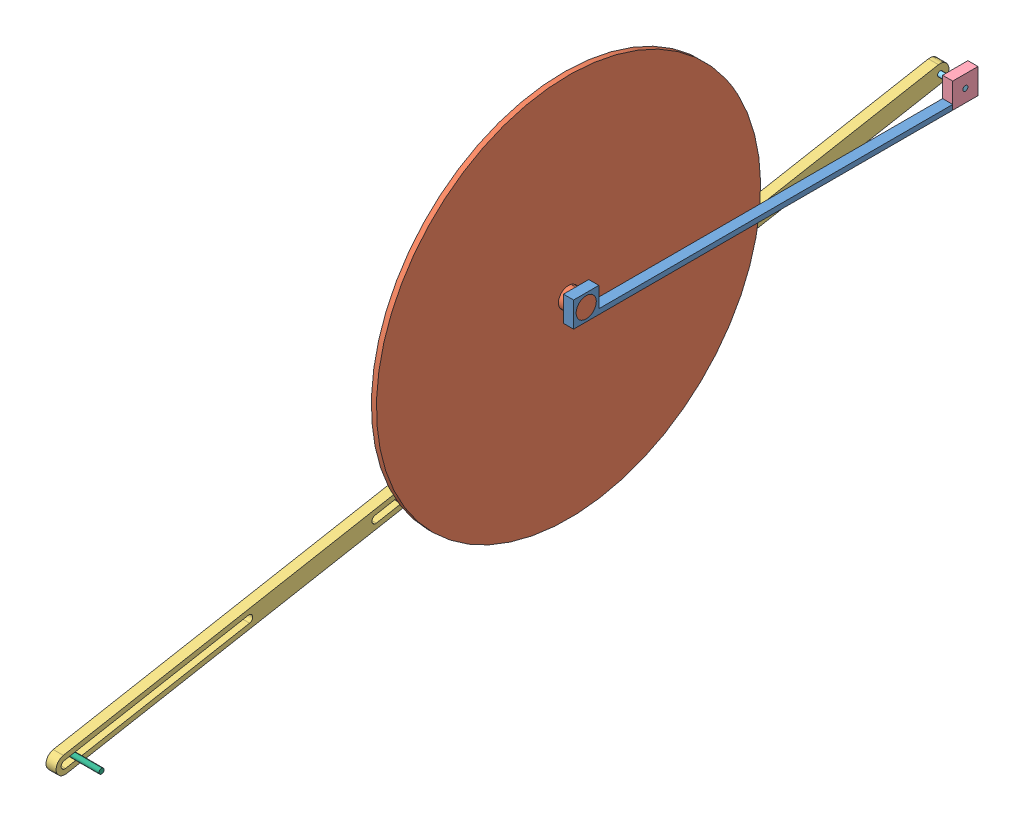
SolidWorks assembly fws.SLDASM, configuration Default (file format 7000). Lengths in mm.
Overall size (71.55 1045.35 1776.47).
6 component instances, 6 part files, 9 mates.
Components (placement in the parent):
- fw holder-1: fw holder.SLDPRT [Default] at (-10.3585 -21.7406 22.9748) size (20 50 750)
- flywheel-1: flywheel.SLDPRT [Default] at (-35.3585 3.2594 -2.0252) x (1 0 0) z (0 -0.523335 0.852127) size (70 760 760)
- qr handle-1: qr handle.SLDPRT [Default] at (-60.3585 3.2594 -752.0252) x (1 0 0) z (0 0.180476 -0.983579) size (20 35 1795)
- qr handle holder-1: qr handle holder.SLDPRT [Default] at (-10.3585 -21.7406 -727.0252) size (20 50 50)
- pin qr-1: pin qr.SLDPRT [Default] at (-60.3585 3.2594 -752.0252) size (70 10 10)
- pin666-1: pin666.SLDPRT [Default] at (11.1885 -310.5335 958.1174) x (0 0 -1) z (1 0 0) size (10 10 71.55)
Mates (geometry in assembly coordinates):
- Coincident1: coincident anti-aligned: plane of fw holder-1 through (-10.3585 -21.7406 -727.0252) normal (0 0 -1); plane of qr handle holder-1 through (9.6415 -21.7406 -727.0252) normal (0 0 1)
- Coincident2: coincident: moEndPointRef_w of fw holder-1; moEndPointRef_w of qr handle holder-1
- Coincident3: coincident aligned: plane of fw holder-1 through (9.6415 -21.7406 22.9748) normal (0 -1 0); plane of qr handle holder-1 through (9.6415 -21.7406 -727.0252) normal (0 -1 0)
- Hinge7: hinge aligned: cylinder of pin qr-1 through (9.6415 3.2594 -752.0252) axis (-1 0 0) radius 5; cylinder of qr handle holder-1 through (9.6415 3.2594 -752.0252) axis (-1 0 0) radius 5; plane of pin qr-1 through (9.6415 3.2594 -752.0252) normal (1 0 0); plane of qr handle holder-1 through (9.6415 -21.7406 -727.0252) normal (1 0 0)
- Hinge8: hinge aligned: cylinder of flywheel-1 through (9.6415 3.2594 -2.0252) axis (-1 0 0) radius 20; cylinder of fw holder-1 through (9.6415 3.2594 -2.0252) axis (-1 0 0) radius 20; plane of flywheel-1 through (9.6415 3.2594 -2.0252) normal (1 0 0); plane of fw holder-1 through (9.6415 -21.7406 22.9748) normal (1 0 0)
- Hinge9: hinge aligned: cylinder of pin qr-1 through (9.6415 3.2594 -752.0252) axis (-1 0 0) radius 5; cylinder of qr handle-1 through (-40.3585 3.2594 -752.0252) axis (-1 0 0) radius 5; plane of pin qr-1 through (-60.3585 3.2594 -752.0252) normal (-1 0 0); plane of qr handle-1 through (-60.3585 3.2594 -752.0252) normal (-1 0 0)
- Slot1: slot anti-aligned: cylinder of flywheel-1 through (-60.3585 -198.4307 314.1174) axis (1 0 0) radius 2.5; plane of qr handle-1 through (-40.3585 -73.8151 -384.9547) normal (0 0.982572 0.18588); cylinder of qr handle-1 through (-40.3585 -207.715 363.1944) axis (-1 0 0) radius 7.5
- Slot2: slot: cylinder of pin666-1 through (-60.3585 -310.5335 958.1174) axis (1 0 0) radius 5; plane of qr handle-1 through (-40.3585 -321.7558 977.7209) normal (0 0.983579 0.180476); cylinder of qr handle-1 through (-40.3585 -314.3789 979.0744) axis (-1 0 0) radius 7.5
- Coincident4: coincident aligned: plane of qr handle-1 through (-60.3585 3.2594 -752.0252) normal (-1 0 0); plane of pin666-1 through (-60.3585 -310.5335 958.1174) normal (-1 0 0)
